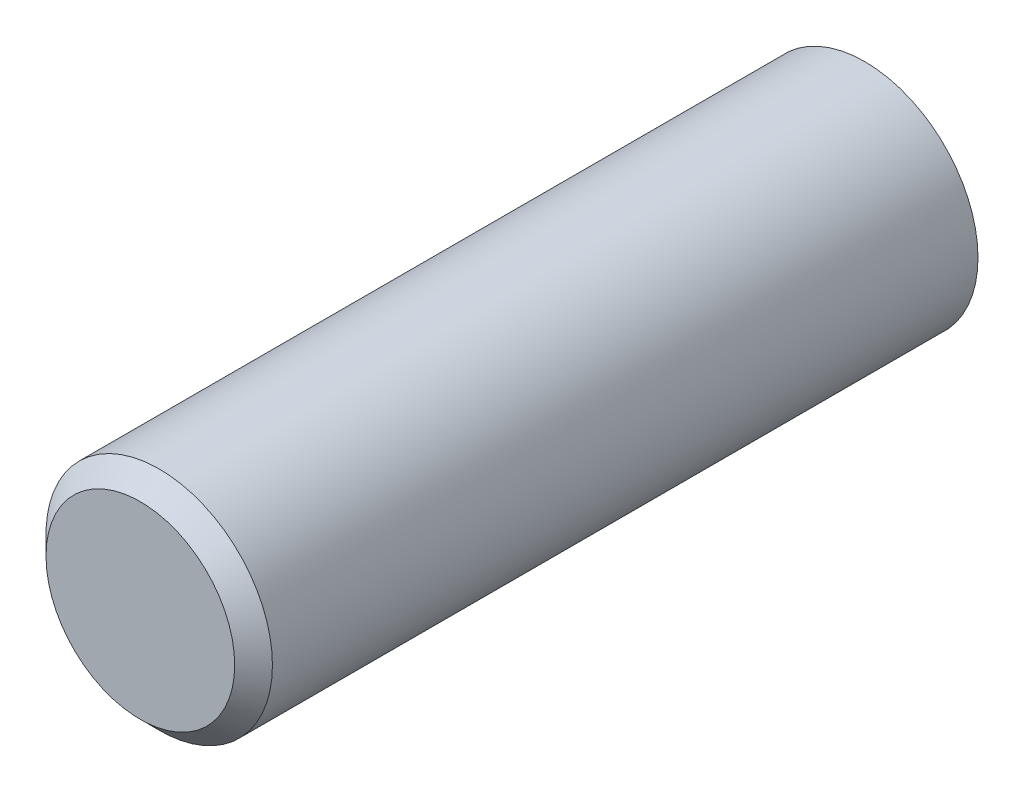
ISO-10303-21;
HEADER;
FILE_DESCRIPTION(('STEP AP214'),'2;1');
FILE_NAME('part.step','',(''),(''),'','','');
FILE_SCHEMA(('AUTOMOTIVE_DESIGN { 1 0 10303 214 1 1 1 1 }'));
ENDSEC;
DATA;
#1=APPLICATION_CONTEXT('core data for automotive mechanical design processes');
#2=APPLICATION_PROTOCOL_DEFINITION('international standard','automotive_design',2000,#1);
#3=PRODUCT_CONTEXT('',#1,'mechanical');
#4=PRODUCT('Part','Part','',(#3));
#5=PRODUCT_RELATED_PRODUCT_CATEGORY('part','',(#4));
#6=PRODUCT_DEFINITION_FORMATION('','',#4);
#7=PRODUCT_DEFINITION_CONTEXT('part definition',#1,'design');
#8=PRODUCT_DEFINITION('design','',#6,#7);
#9=PRODUCT_DEFINITION_SHAPE('','',#8);
#10=(LENGTH_UNIT() NAMED_UNIT(*) SI_UNIT(.MILLI.,.METRE.));
#11=(NAMED_UNIT(*) PLANE_ANGLE_UNIT() SI_UNIT($,.RADIAN.));
#12=(NAMED_UNIT(*) SI_UNIT($,.STERADIAN.) SOLID_ANGLE_UNIT());
#13=UNCERTAINTY_MEASURE_WITH_UNIT(LENGTH_MEASURE(1.E-05),#10,'distance_accuracy_value','');
#14=(GEOMETRIC_REPRESENTATION_CONTEXT(3) GLOBAL_UNCERTAINTY_ASSIGNED_CONTEXT((#13)) GLOBAL_UNIT_ASSIGNED_CONTEXT((#10,
#11,#12)) REPRESENTATION_CONTEXT('',''));
#15=CARTESIAN_POINT('',(0.,0.,0.));
#16=DIRECTION('',(0.,0.,1.));
#17=DIRECTION('',(1.,0.,0.));
#18=AXIS2_PLACEMENT_3D('',#15,#16,#17);
#19=CARTESIAN_POINT('',(-2.5,0.,20.));
#20=DIRECTION('',(0.,0.,-1.));
#21=DIRECTION('',(-1.,0.,0.));
#22=AXIS2_PLACEMENT_3D('',#19,#20,#21);
#23=PLANE('',#22);
#24=CARTESIAN_POINT('',(0.,0.,20.));
#25=DIRECTION('',(0.,0.,1.));
#26=DIRECTION('',(1.,0.,0.));
#27=AXIS2_PLACEMENT_3D('',#24,#25,#26);
#28=CIRCLE('',#27,2.5);
#29=CARTESIAN_POINT('',(2.5,0.,20.));
#30=VERTEX_POINT('',#29);
#31=EDGE_CURVE('E22',#30,#30,#28,.T.);
#32=ORIENTED_EDGE('',*,*,#31,.T.);
#33=EDGE_LOOP('',(#32));
#34=FACE_BOUND('',#33,.T.);
#35=ADVANCED_FACE('F12',(#34),#23,.F.);
#36=CARTESIAN_POINT('',(0.,0.,6.));
#37=DIRECTION('',(0.,0.,1.));
#38=DIRECTION('',(-1.,0.,0.));
#39=AXIS2_PLACEMENT_3D('',#36,#37,#38);
#40=SPHERICAL_SURFACE('',#39,6.);
#41=CARTESIAN_POINT('',(0.,0.,0.803847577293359));
#42=DIRECTION('',(0.,0.,1.));
#43=DIRECTION('',(1.,0.,0.));
#44=AXIS2_PLACEMENT_3D('',#41,#42,#43);
#45=CIRCLE('',#44,3.);
#46=CARTESIAN_POINT('',(3.,0.,0.803847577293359));
#47=VERTEX_POINT('',#46);
#48=EDGE_CURVE('E8',#47,#47,#45,.T.);
#49=ORIENTED_EDGE('',*,*,#48,.F.);
#50=EDGE_LOOP('',(#49));
#51=FACE_BOUND('',#50,.T.);
#52=ADVANCED_FACE('F39',(#51),#40,.T.);
#53=CARTESIAN_POINT('',(0.,0.,62.7426335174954));
#54=DIRECTION('',(0.,0.,1.));
#55=DIRECTION('',(1.,0.,0.));
#56=AXIS2_PLACEMENT_3D('',#53,#54,#55);
#57=CYLINDRICAL_SURFACE('',#56,3.);
#58=ORIENTED_EDGE('',*,*,#48,.T.);
#59=EDGE_LOOP('',(#58));
#60=FACE_BOUND('',#59,.T.);
#61=CARTESIAN_POINT('',(0.,0.,19.5));
#62=DIRECTION('',(0.,0.,1.));
#63=DIRECTION('',(1.,0.,0.));
#64=AXIS2_PLACEMENT_3D('',#61,#62,#63);
#65=CIRCLE('',#64,3.);
#66=CARTESIAN_POINT('',(3.,0.,19.5));
#67=VERTEX_POINT('',#66);
#68=EDGE_CURVE('E18',#67,#67,#65,.T.);
#69=ORIENTED_EDGE('',*,*,#68,.F.);
#70=EDGE_LOOP('',(#69));
#71=FACE_BOUND('',#70,.T.);
#72=ADVANCED_FACE('F32',(#60,#71),#57,.T.);
#73=CARTESIAN_POINT('',(0.,0.,19.5));
#74=DIRECTION('',(0.,0.,-1.));
#75=DIRECTION('',(-1.,0.,0.));
#76=AXIS2_PLACEMENT_3D('',#73,#74,#75);
#77=CONICAL_SURFACE('',#76,3.,0.785398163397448);
#78=ORIENTED_EDGE('',*,*,#68,.T.);
#79=EDGE_LOOP('',(#78));
#80=FACE_BOUND('',#79,.T.);
#81=ORIENTED_EDGE('',*,*,#31,.F.);
#82=EDGE_LOOP('',(#81));
#83=FACE_BOUND('',#82,.T.);
#84=ADVANCED_FACE('F30',(#80,#83),#77,.T.);
#85=CLOSED_SHELL('',(#35,#52,#72,#84));
#86=MANIFOLD_SOLID_BREP('B1',#85);
#87=ADVANCED_BREP_SHAPE_REPRESENTATION('',(#18,#86),#14);
#88=SHAPE_DEFINITION_REPRESENTATION(#9,#87);
ENDSEC;
END-ISO-10303-21;
